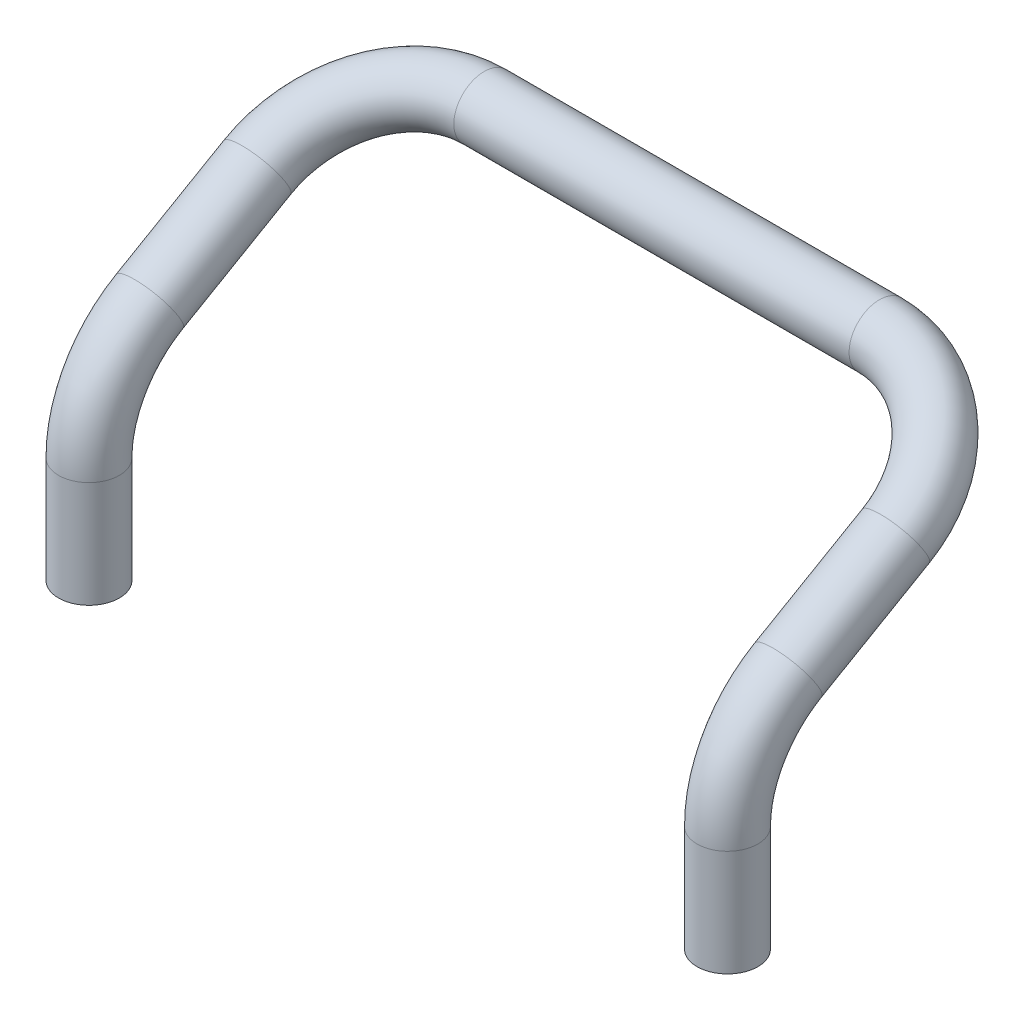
ISO-10303-21;
HEADER;
FILE_DESCRIPTION(('STEP AP214'),'2;1');
FILE_NAME('part.step','',(''),(''),'','','');
FILE_SCHEMA(('AUTOMOTIVE_DESIGN { 1 0 10303 214 1 1 1 1 }'));
ENDSEC;
DATA;
#1=APPLICATION_CONTEXT('core data for automotive mechanical design processes');
#2=APPLICATION_PROTOCOL_DEFINITION('international standard','automotive_design',2000,#1);
#3=PRODUCT_CONTEXT('',#1,'mechanical');
#4=PRODUCT('Part','Part','',(#3));
#5=PRODUCT_RELATED_PRODUCT_CATEGORY('part','',(#4));
#6=PRODUCT_DEFINITION_FORMATION('','',#4);
#7=PRODUCT_DEFINITION_CONTEXT('part definition',#1,'design');
#8=PRODUCT_DEFINITION('design','',#6,#7);
#9=PRODUCT_DEFINITION_SHAPE('','',#8);
#10=(LENGTH_UNIT() NAMED_UNIT(*) SI_UNIT(.MILLI.,.METRE.));
#11=(NAMED_UNIT(*) PLANE_ANGLE_UNIT() SI_UNIT($,.RADIAN.));
#12=(NAMED_UNIT(*) SI_UNIT($,.STERADIAN.) SOLID_ANGLE_UNIT());
#13=UNCERTAINTY_MEASURE_WITH_UNIT(LENGTH_MEASURE(1.E-05),#10,'distance_accuracy_value','');
#14=(GEOMETRIC_REPRESENTATION_CONTEXT(3) GLOBAL_UNCERTAINTY_ASSIGNED_CONTEXT((#13)) GLOBAL_UNIT_ASSIGNED_CONTEXT((#10,
#11,#12)) REPRESENTATION_CONTEXT('',''));
#15=CARTESIAN_POINT('',(0.,0.,0.));
#16=DIRECTION('',(0.,0.,1.));
#17=DIRECTION('',(1.,0.,0.));
#18=AXIS2_PLACEMENT_3D('',#15,#16,#17);
#19=CARTESIAN_POINT('',(52.5,0.,0.));
#20=DIRECTION('',(0.,-1.,0.));
#21=DIRECTION('',(0.866025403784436,0.,-0.500000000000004));
#22=AXIS2_PLACEMENT_3D('',#19,#20,#21);
#23=PLANE('',#22);
#24=CARTESIAN_POINT('',(52.5,0.,0.));
#25=DIRECTION('',(0.,-1.,0.));
#26=DIRECTION('',(0.866025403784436,0.,-0.500000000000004));
#27=AXIS2_PLACEMENT_3D('',#24,#25,#26);
#28=CIRCLE('',#27,5.);
#29=CARTESIAN_POINT('',(56.8301270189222,0.,-2.50000000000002));
#30=VERTEX_POINT('',#29);
#31=EDGE_CURVE('E11',#30,#30,#28,.T.);
#32=ORIENTED_EDGE('',*,*,#31,.T.);
#33=EDGE_LOOP('',(#32));
#34=FACE_BOUND('',#33,.T.);
#35=ADVANCED_FACE('F51',(#34),#23,.T.);
#36=CARTESIAN_POINT('',(0.,55.,-45.));
#37=DIRECTION('',(1.,0.,0.));
#38=DIRECTION('',(0.,0.,-1.));
#39=AXIS2_PLACEMENT_3D('',#36,#37,#38);
#40=CYLINDRICAL_SURFACE('',#39,5.);
#41=CARTESIAN_POINT('',(32.5,55.,-45.));
#42=DIRECTION('',(1.,0.,0.));
#43=DIRECTION('',(0.,0.,-1.));
#44=AXIS2_PLACEMENT_3D('',#41,#42,#43);
#45=CIRCLE('',#44,5.);
#46=CARTESIAN_POINT('',(32.5,57.5,-49.3301270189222));
#47=VERTEX_POINT('',#46);
#48=EDGE_CURVE('E70',#47,#47,#45,.T.);
#49=ORIENTED_EDGE('',*,*,#48,.F.);
#50=EDGE_LOOP('',(#49));
#51=FACE_BOUND('',#50,.T.);
#52=CARTESIAN_POINT('',(-32.5,55.,-45.));
#53=DIRECTION('',(1.,0.,0.));
#54=DIRECTION('',(0.,0.,-1.));
#55=AXIS2_PLACEMENT_3D('',#52,#53,#54);
#56=CIRCLE('',#55,5.);
#57=CARTESIAN_POINT('',(-32.5,57.5,-49.3301270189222));
#58=VERTEX_POINT('',#57);
#59=EDGE_CURVE('E85',#58,#58,#56,.T.);
#60=ORIENTED_EDGE('',*,*,#59,.T.);
#61=EDGE_LOOP('',(#60));
#62=FACE_BOUND('',#61,.T.);
#63=ADVANCED_FACE('F89',(#51,#62),#40,.T.);
#64=CARTESIAN_POINT('',(32.5,44.9999999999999,-27.6794919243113));
#65=DIRECTION('',(0.,-0.866025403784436,-0.500000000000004));
#66=DIRECTION('',(0.,0.500000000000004,-0.866025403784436));
#67=AXIS2_PLACEMENT_3D('',#64,#65,#66);
#68=TOROIDAL_SURFACE('',#67,20.,5.);
#69=CARTESIAN_POINT('',(52.5,44.9999999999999,-27.6794919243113));
#70=DIRECTION('',(0.,-0.500000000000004,0.866025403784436));
#71=DIRECTION('',(0.866025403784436,-0.433012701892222,-0.250000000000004));
#72=AXIS2_PLACEMENT_3D('',#69,#70,#71);
#73=CIRCLE('',#72,5.);
#74=CARTESIAN_POINT('',(57.5,44.9999999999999,-27.6794919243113));
#75=VERTEX_POINT('',#74);
#76=EDGE_CURVE('E65',#75,#75,#73,.T.);
#77=CARTESIAN_POINT('',(32.5,44.9999999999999,-27.6794919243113));
#78=DIRECTION('',(0.,-0.866025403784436,-0.500000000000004));
#79=DIRECTION('',(0.,0.500000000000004,-0.866025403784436));
#80=AXIS2_PLACEMENT_3D('',#77,#78,#79);
#81=CIRCLE('',#80,25.);
#82=EDGE_CURVE('',#47,#75,#81,.T.);
#83=ORIENTED_EDGE('',*,*,#48,.T.);
#84=ORIENTED_EDGE('',*,*,#76,.F.);
#85=ORIENTED_EDGE('',*,*,#82,.T.);
#86=ORIENTED_EDGE('',*,*,#82,.F.);
#87=EDGE_LOOP('',(#83,#85,#84,#86));
#88=FACE_BOUND('',#87,.T.);
#89=ADVANCED_FACE('F120',(#88),#68,.T.);
#90=CARTESIAN_POINT('',(52.5,44.9999999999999,-27.6794919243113));
#91=DIRECTION('',(0.,-0.500000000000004,0.866025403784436));
#92=DIRECTION('',(0.,-0.866025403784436,-0.500000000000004));
#93=AXIS2_PLACEMENT_3D('',#90,#91,#92);
#94=CYLINDRICAL_SURFACE('',#93,5.);
#95=CARTESIAN_POINT('',(52.5,34.7927405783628,-9.99999999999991));
#96=DIRECTION('',(0.,-0.500000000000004,0.866025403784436));
#97=DIRECTION('',(0.866025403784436,-0.433012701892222,-0.250000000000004));
#98=AXIS2_PLACEMENT_3D('',#95,#96,#97);
#99=CIRCLE('',#98,5.);
#100=CARTESIAN_POINT('',(52.5,39.122867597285,-7.49999999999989));
#101=VERTEX_POINT('',#100);
#102=EDGE_CURVE('E61',#101,#101,#99,.T.);
#103=ORIENTED_EDGE('',*,*,#102,.F.);
#104=EDGE_LOOP('',(#103));
#105=FACE_BOUND('',#104,.T.);
#106=ORIENTED_EDGE('',*,*,#76,.T.);
#107=EDGE_LOOP('',(#106));
#108=FACE_BOUND('',#107,.T.);
#109=ADVANCED_FACE('F114',(#105,#108),#94,.T.);
#110=CARTESIAN_POINT('',(52.5,17.4722325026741,-20.));
#111=DIRECTION('',(1.,0.,0.));
#112=DIRECTION('',(0.,0.,-1.));
#113=AXIS2_PLACEMENT_3D('',#110,#111,#112);
#114=TOROIDAL_SURFACE('',#113,20.,5.);
#115=CARTESIAN_POINT('',(52.5,17.4722325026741,0.));
#116=DIRECTION('',(0.,-1.,0.));
#117=DIRECTION('',(0.866025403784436,0.,-0.500000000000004));
#118=AXIS2_PLACEMENT_3D('',#115,#116,#117);
#119=CIRCLE('',#118,5.);
#120=CARTESIAN_POINT('',(52.5,17.4722325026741,5.));
#121=VERTEX_POINT('',#120);
#122=EDGE_CURVE('E57',#121,#121,#119,.T.);
#123=CARTESIAN_POINT('',(52.5,17.4722325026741,-20.));
#124=DIRECTION('',(1.,0.,0.));
#125=DIRECTION('',(0.,0.,-1.));
#126=AXIS2_PLACEMENT_3D('',#123,#124,#125);
#127=CIRCLE('',#126,25.);
#128=EDGE_CURVE('',#101,#121,#127,.T.);
#129=ORIENTED_EDGE('',*,*,#102,.T.);
#130=ORIENTED_EDGE('',*,*,#122,.F.);
#131=ORIENTED_EDGE('',*,*,#128,.T.);
#132=ORIENTED_EDGE('',*,*,#128,.F.);
#133=EDGE_LOOP('',(#129,#131,#130,#132));
#134=FACE_BOUND('',#133,.T.);
#135=ADVANCED_FACE('F108',(#134),#114,.T.);
#136=CARTESIAN_POINT('',(52.5,17.4722325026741,0.));
#137=DIRECTION('',(0.,-1.,0.));
#138=DIRECTION('',(0.,0.,-1.));
#139=AXIS2_PLACEMENT_3D('',#136,#137,#138);
#140=CYLINDRICAL_SURFACE('',#139,5.);
#141=ORIENTED_EDGE('',*,*,#31,.F.);
#142=EDGE_LOOP('',(#141));
#143=FACE_BOUND('',#142,.T.);
#144=ORIENTED_EDGE('',*,*,#122,.T.);
#145=EDGE_LOOP('',(#144));
#146=FACE_BOUND('',#145,.T.);
#147=ADVANCED_FACE('F104',(#143,#146),#140,.T.);
#148=CARTESIAN_POINT('',(-52.5,0.,0.));
#149=DIRECTION('',(0.,-1.,0.));
#150=DIRECTION('',(-0.866025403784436,0.,-0.500000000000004));
#151=AXIS2_PLACEMENT_3D('',#148,#149,#150);
#152=PLANE('',#151);
#153=CARTESIAN_POINT('',(-52.5,0.,0.));
#154=DIRECTION('',(0.,1.,0.));
#155=DIRECTION('',(-0.866025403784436,0.,-0.500000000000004));
#156=AXIS2_PLACEMENT_3D('',#153,#154,#155);
#157=CIRCLE('',#156,5.);
#158=CARTESIAN_POINT('',(-56.8301270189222,0.,-2.50000000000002));
#159=VERTEX_POINT('',#158);
#160=EDGE_CURVE('E73',#159,#159,#157,.T.);
#161=ORIENTED_EDGE('',*,*,#160,.F.);
#162=EDGE_LOOP('',(#161));
#163=FACE_BOUND('',#162,.T.);
#164=ADVANCED_FACE('F94',(#163),#152,.T.);
#165=CARTESIAN_POINT('',(-32.5,44.9999999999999,-27.6794919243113));
#166=DIRECTION('',(0.,-0.866025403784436,-0.500000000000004));
#167=DIRECTION('',(0.,0.500000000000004,-0.866025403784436));
#168=AXIS2_PLACEMENT_3D('',#165,#166,#167);
#169=TOROIDAL_SURFACE('',#168,20.,5.);
#170=CARTESIAN_POINT('',(-52.5,44.9999999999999,-27.6794919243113));
#171=DIRECTION('',(0.,0.500000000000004,-0.866025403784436));
#172=DIRECTION('',(-0.866025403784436,-0.433012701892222,-0.250000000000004));
#173=AXIS2_PLACEMENT_3D('',#170,#171,#172);
#174=CIRCLE('',#173,5.);
#175=CARTESIAN_POINT('',(-57.5,44.9999999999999,-27.6794919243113));
#176=VERTEX_POINT('',#175);
#177=EDGE_CURVE('E82',#176,#176,#174,.T.);
#178=CARTESIAN_POINT('',(-32.5,44.9999999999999,-27.6794919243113));
#179=DIRECTION('',(0.,-0.866025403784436,-0.500000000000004));
#180=DIRECTION('',(0.,0.500000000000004,-0.866025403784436));
#181=AXIS2_PLACEMENT_3D('',#178,#179,#180);
#182=CIRCLE('',#181,25.);
#183=EDGE_CURVE('',#176,#58,#182,.T.);
#184=ORIENTED_EDGE('',*,*,#177,.T.);
#185=ORIENTED_EDGE('',*,*,#59,.F.);
#186=ORIENTED_EDGE('',*,*,#183,.T.);
#187=ORIENTED_EDGE('',*,*,#183,.F.);
#188=EDGE_LOOP('',(#184,#186,#185,#187));
#189=FACE_BOUND('',#188,.T.);
#190=ADVANCED_FACE('F91',(#189),#169,.T.);
#191=CARTESIAN_POINT('',(-52.5,44.9999999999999,-27.6794919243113));
#192=DIRECTION('',(0.,-0.500000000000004,0.866025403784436));
#193=DIRECTION('',(0.,-0.866025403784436,-0.500000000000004));
#194=AXIS2_PLACEMENT_3D('',#191,#192,#193);
#195=CYLINDRICAL_SURFACE('',#194,5.);
#196=CARTESIAN_POINT('',(-52.5,34.7927405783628,-9.99999999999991));
#197=DIRECTION('',(0.,0.500000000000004,-0.866025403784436));
#198=DIRECTION('',(-0.866025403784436,-0.433012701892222,-0.250000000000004));
#199=AXIS2_PLACEMENT_3D('',#196,#197,#198);
#200=CIRCLE('',#199,5.);
#201=CARTESIAN_POINT('',(-52.5,39.122867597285,-7.49999999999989));
#202=VERTEX_POINT('',#201);
#203=EDGE_CURVE('E79',#202,#202,#200,.T.);
#204=ORIENTED_EDGE('',*,*,#203,.T.);
#205=EDGE_LOOP('',(#204));
#206=FACE_BOUND('',#205,.T.);
#207=ORIENTED_EDGE('',*,*,#177,.F.);
#208=EDGE_LOOP('',(#207));
#209=FACE_BOUND('',#208,.T.);
#210=ADVANCED_FACE('F93',(#206,#209),#195,.T.);
#211=CARTESIAN_POINT('',(-52.5,17.4722325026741,-20.));
#212=DIRECTION('',(-1.,0.,0.));
#213=DIRECTION('',(0.,0.,-1.));
#214=AXIS2_PLACEMENT_3D('',#211,#212,#213);
#215=TOROIDAL_SURFACE('',#214,20.,5.);
#216=CARTESIAN_POINT('',(-52.5,17.4722325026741,0.));
#217=DIRECTION('',(0.,1.,0.));
#218=DIRECTION('',(-0.866025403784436,0.,-0.500000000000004));
#219=AXIS2_PLACEMENT_3D('',#216,#217,#218);
#220=CIRCLE('',#219,5.);
#221=CARTESIAN_POINT('',(-52.5,17.4722325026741,5.));
#222=VERTEX_POINT('',#221);
#223=EDGE_CURVE('E76',#222,#222,#220,.T.);
#224=CARTESIAN_POINT('',(-52.5,17.4722325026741,-20.));
#225=DIRECTION('',(-1.,0.,0.));
#226=DIRECTION('',(0.,0.,-1.));
#227=AXIS2_PLACEMENT_3D('',#224,#225,#226);
#228=CIRCLE('',#227,25.);
#229=EDGE_CURVE('',#222,#202,#228,.T.);
#230=ORIENTED_EDGE('',*,*,#223,.T.);
#231=ORIENTED_EDGE('',*,*,#203,.F.);
#232=ORIENTED_EDGE('',*,*,#229,.T.);
#233=ORIENTED_EDGE('',*,*,#229,.F.);
#234=EDGE_LOOP('',(#230,#232,#231,#233));
#235=FACE_BOUND('',#234,.T.);
#236=ADVANCED_FACE('F101',(#235),#215,.T.);
#237=CARTESIAN_POINT('',(-52.5,17.4722325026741,0.));
#238=DIRECTION('',(0.,-1.,0.));
#239=DIRECTION('',(0.,0.,-1.));
#240=AXIS2_PLACEMENT_3D('',#237,#238,#239);
#241=CYLINDRICAL_SURFACE('',#240,5.);
#242=ORIENTED_EDGE('',*,*,#160,.T.);
#243=EDGE_LOOP('',(#242));
#244=FACE_BOUND('',#243,.T.);
#245=ORIENTED_EDGE('',*,*,#223,.F.);
#246=EDGE_LOOP('',(#245));
#247=FACE_BOUND('',#246,.T.);
#248=ADVANCED_FACE('F128',(#244,#247),#241,.T.);
#249=CLOSED_SHELL('',(#35,#63,#89,#109,#135,#147,#164,#190,#210,#236,#248));
#250=MANIFOLD_SOLID_BREP('B2',#249);
#251=ADVANCED_BREP_SHAPE_REPRESENTATION('',(#18,#250),#14);
#252=SHAPE_DEFINITION_REPRESENTATION(#9,#251);
ENDSEC;
END-ISO-10303-21;
